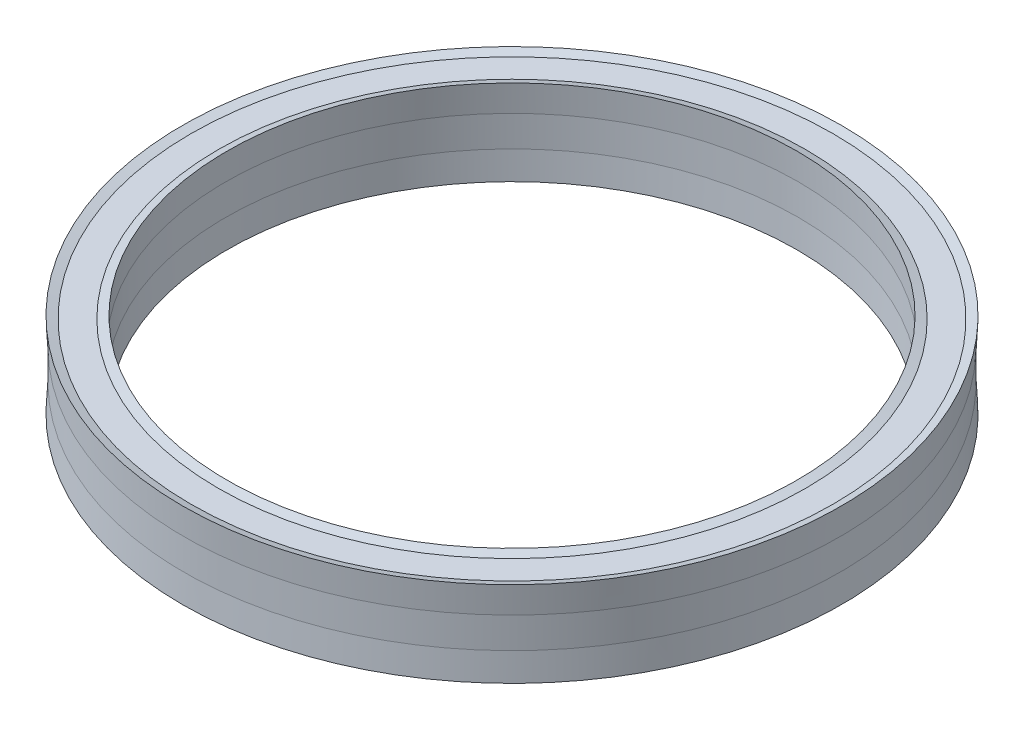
ISO-10303-21;
HEADER;
FILE_DESCRIPTION(('STEP AP214'),'2;1');
FILE_NAME('part.step','',(''),(''),'','','');
FILE_SCHEMA(('AUTOMOTIVE_DESIGN { 1 0 10303 214 1 1 1 1 }'));
ENDSEC;
DATA;
#1=APPLICATION_CONTEXT('core data for automotive mechanical design processes');
#2=APPLICATION_PROTOCOL_DEFINITION('international standard','automotive_design',2000,#1);
#3=PRODUCT_CONTEXT('',#1,'mechanical');
#4=PRODUCT('Part','Part','',(#3));
#5=PRODUCT_RELATED_PRODUCT_CATEGORY('part','',(#4));
#6=PRODUCT_DEFINITION_FORMATION('','',#4);
#7=PRODUCT_DEFINITION_CONTEXT('part definition',#1,'design');
#8=PRODUCT_DEFINITION('design','',#6,#7);
#9=PRODUCT_DEFINITION_SHAPE('','',#8);
#10=(LENGTH_UNIT() NAMED_UNIT(*) SI_UNIT(.MILLI.,.METRE.));
#11=(NAMED_UNIT(*) PLANE_ANGLE_UNIT() SI_UNIT($,.RADIAN.));
#12=(NAMED_UNIT(*) SI_UNIT($,.STERADIAN.) SOLID_ANGLE_UNIT());
#13=UNCERTAINTY_MEASURE_WITH_UNIT(LENGTH_MEASURE(1.E-05),#10,'distance_accuracy_value','');
#14=(GEOMETRIC_REPRESENTATION_CONTEXT(3) GLOBAL_UNCERTAINTY_ASSIGNED_CONTEXT((#13)) GLOBAL_UNIT_ASSIGNED_CONTEXT((#10,
#11,#12)) REPRESENTATION_CONTEXT('',''));
#15=CARTESIAN_POINT('',(0.,0.,0.));
#16=DIRECTION('',(0.,0.,1.));
#17=DIRECTION('',(1.,0.,0.));
#18=AXIS2_PLACEMENT_3D('',#15,#16,#17);
#19=CARTESIAN_POINT('',(0.,3.683,0.));
#20=DIRECTION('',(0.,-1.,0.));
#21=DIRECTION('',(0.,0.,-1.));
#22=AXIS2_PLACEMENT_3D('',#19,#20,#21);
#23=CONICAL_SURFACE('',#22,13.081,1.24904577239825);
#24=CARTESIAN_POINT('',(0.,3.81,0.));
#25=DIRECTION('',(0.,-1.,0.));
#26=DIRECTION('',(0.,0.,-1.));
#27=AXIS2_PLACEMENT_3D('',#24,#25,#26);
#28=CIRCLE('',#27,12.7);
#29=CARTESIAN_POINT('',(0.,3.81,-12.7));
#30=VERTEX_POINT('',#29);
#31=EDGE_CURVE('E68',#30,#30,#28,.T.);
#32=ORIENTED_EDGE('',*,*,#31,.T.);
#33=EDGE_LOOP('',(#32));
#34=FACE_BOUND('',#33,.T.);
#35=CARTESIAN_POINT('',(0.,3.683,0.));
#36=DIRECTION('',(0.,-1.,0.));
#37=DIRECTION('',(0.,0.,-1.));
#38=AXIS2_PLACEMENT_3D('',#35,#36,#37);
#39=CIRCLE('',#38,13.081);
#40=CARTESIAN_POINT('',(0.,3.683,-13.081));
#41=VERTEX_POINT('',#40);
#42=EDGE_CURVE('E10',#41,#41,#39,.T.);
#43=ORIENTED_EDGE('',*,*,#42,.F.);
#44=EDGE_LOOP('',(#43));
#45=FACE_BOUND('',#44,.T.);
#46=ADVANCED_FACE('F28',(#34,#45),#23,.T.);
#47=CARTESIAN_POINT('',(13.081,3.683,0.));
#48=DIRECTION('',(0.,1.,0.));
#49=DIRECTION('',(0.,0.,1.));
#50=AXIS2_PLACEMENT_3D('',#47,#48,#49);
#51=PLANE('',#50);
#52=ORIENTED_EDGE('',*,*,#42,.T.);
#53=EDGE_LOOP('',(#52));
#54=FACE_BOUND('',#53,.T.);
#55=CARTESIAN_POINT('',(0.,3.683,0.));
#56=DIRECTION('',(0.,-1.,0.));
#57=DIRECTION('',(0.,0.,-1.));
#58=AXIS2_PLACEMENT_3D('',#55,#56,#57);
#59=CIRCLE('',#58,14.303375);
#60=CARTESIAN_POINT('',(0.,3.683,-14.303375));
#61=VERTEX_POINT('',#60);
#62=EDGE_CURVE('E34',#61,#61,#59,.T.);
#63=ORIENTED_EDGE('',*,*,#62,.F.);
#64=EDGE_LOOP('',(#63));
#65=FACE_BOUND('',#64,.T.);
#66=ADVANCED_FACE('F86',(#54,#65),#51,.T.);
#67=CARTESIAN_POINT('',(0.,3.81,0.));
#68=DIRECTION('',(0.,1.,0.));
#69=DIRECTION('',(0.,0.,1.));
#70=AXIS2_PLACEMENT_3D('',#67,#68,#69);
#71=CONICAL_SURFACE('',#70,14.684375,1.24904577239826);
#72=ORIENTED_EDGE('',*,*,#62,.T.);
#73=EDGE_LOOP('',(#72));
#74=FACE_BOUND('',#73,.T.);
#75=CARTESIAN_POINT('',(0.,3.81,0.));
#76=DIRECTION('',(0.,-1.,0.));
#77=DIRECTION('',(0.,0.,-1.));
#78=AXIS2_PLACEMENT_3D('',#75,#76,#77);
#79=CIRCLE('',#78,14.684375);
#80=CARTESIAN_POINT('',(0.,3.81,-14.684375));
#81=VERTEX_POINT('',#80);
#82=EDGE_CURVE('E38',#81,#81,#79,.T.);
#83=ORIENTED_EDGE('',*,*,#82,.F.);
#84=EDGE_LOOP('',(#83));
#85=FACE_BOUND('',#84,.T.);
#86=ADVANCED_FACE('F90',(#74,#85),#71,.F.);
#87=CARTESIAN_POINT('',(0.,2.5908,0.));
#88=DIRECTION('',(0.,1.,0.));
#89=DIRECTION('',(0.,0.,1.));
#90=AXIS2_PLACEMENT_3D('',#87,#88,#89);
#91=CONICAL_SURFACE('',#90,14.620875,0.0520363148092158);
#92=ORIENTED_EDGE('',*,*,#82,.T.);
#93=EDGE_LOOP('',(#92));
#94=FACE_BOUND('',#93,.T.);
#95=CARTESIAN_POINT('',(0.,2.5908,0.));
#96=DIRECTION('',(0.,-1.,0.));
#97=DIRECTION('',(0.,0.,-1.));
#98=AXIS2_PLACEMENT_3D('',#95,#96,#97);
#99=CIRCLE('',#98,14.620875);
#100=CARTESIAN_POINT('',(0.,2.5908,-14.620875));
#101=VERTEX_POINT('',#100);
#102=EDGE_CURVE('E42',#101,#101,#99,.T.);
#103=ORIENTED_EDGE('',*,*,#102,.F.);
#104=EDGE_LOOP('',(#103));
#105=FACE_BOUND('',#104,.T.);
#106=ADVANCED_FACE('F94',(#94,#105),#91,.T.);
#107=CARTESIAN_POINT('',(0.,0.,0.));
#108=DIRECTION('',(0.,-1.,0.));
#109=DIRECTION('',(0.,0.,-1.));
#110=AXIS2_PLACEMENT_3D('',#107,#108,#109);
#111=CYLINDRICAL_SURFACE('',#110,14.620875);
#112=ORIENTED_EDGE('',*,*,#102,.T.);
#113=EDGE_LOOP('',(#112));
#114=FACE_BOUND('',#113,.T.);
#115=CARTESIAN_POINT('',(0.,1.2192,0.));
#116=DIRECTION('',(0.,-1.,0.));
#117=DIRECTION('',(0.,0.,-1.));
#118=AXIS2_PLACEMENT_3D('',#115,#116,#117);
#119=CIRCLE('',#118,14.620875);
#120=CARTESIAN_POINT('',(0.,1.2192,-14.620875));
#121=VERTEX_POINT('',#120);
#122=EDGE_CURVE('E47',#121,#121,#119,.T.);
#123=ORIENTED_EDGE('',*,*,#122,.F.);
#124=EDGE_LOOP('',(#123));
#125=FACE_BOUND('',#124,.T.);
#126=ADVANCED_FACE('F100',(#114,#125),#111,.T.);
#127=CARTESIAN_POINT('',(0.,0.,0.));
#128=DIRECTION('',(0.,-1.,0.));
#129=DIRECTION('',(0.,0.,-1.));
#130=AXIS2_PLACEMENT_3D('',#127,#128,#129);
#131=CONICAL_SURFACE('',#130,14.684375,0.0520363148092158);
#132=ORIENTED_EDGE('',*,*,#122,.T.);
#133=EDGE_LOOP('',(#132));
#134=FACE_BOUND('',#133,.T.);
#135=CARTESIAN_POINT('',(0.,0.,0.));
#136=DIRECTION('',(0.,-1.,0.));
#137=DIRECTION('',(0.,0.,-1.));
#138=AXIS2_PLACEMENT_3D('',#135,#136,#137);
#139=CIRCLE('',#138,14.684375);
#140=CARTESIAN_POINT('',(0.,0.,-14.684375));
#141=VERTEX_POINT('',#140);
#142=EDGE_CURVE('E50',#141,#141,#139,.T.);
#143=ORIENTED_EDGE('',*,*,#142,.F.);
#144=EDGE_LOOP('',(#143));
#145=FACE_BOUND('',#144,.T.);
#146=ADVANCED_FACE('F104',(#134,#145),#131,.T.);
#147=CARTESIAN_POINT('',(0.,0.127,0.));
#148=DIRECTION('',(0.,-1.,0.));
#149=DIRECTION('',(0.,0.,-1.));
#150=AXIS2_PLACEMENT_3D('',#147,#148,#149);
#151=CONICAL_SURFACE('',#150,14.303375,1.24904577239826);
#152=ORIENTED_EDGE('',*,*,#142,.T.);
#153=EDGE_LOOP('',(#152));
#154=FACE_BOUND('',#153,.T.);
#155=CARTESIAN_POINT('',(0.,0.127,0.));
#156=DIRECTION('',(0.,-1.,0.));
#157=DIRECTION('',(0.,0.,-1.));
#158=AXIS2_PLACEMENT_3D('',#155,#156,#157);
#159=CIRCLE('',#158,14.303375);
#160=CARTESIAN_POINT('',(0.,0.127,-14.303375));
#161=VERTEX_POINT('',#160);
#162=EDGE_CURVE('E53',#161,#161,#159,.T.);
#163=ORIENTED_EDGE('',*,*,#162,.F.);
#164=EDGE_LOOP('',(#163));
#165=FACE_BOUND('',#164,.T.);
#166=ADVANCED_FACE('F108',(#154,#165),#151,.F.);
#167=CARTESIAN_POINT('',(13.081,0.127,0.));
#168=DIRECTION('',(0.,-1.,0.));
#169=DIRECTION('',(0.,0.,-1.));
#170=AXIS2_PLACEMENT_3D('',#167,#168,#169);
#171=PLANE('',#170);
#172=ORIENTED_EDGE('',*,*,#162,.T.);
#173=EDGE_LOOP('',(#172));
#174=FACE_BOUND('',#173,.T.);
#175=CARTESIAN_POINT('',(0.,0.127,0.));
#176=DIRECTION('',(0.,-1.,0.));
#177=DIRECTION('',(0.,0.,-1.));
#178=AXIS2_PLACEMENT_3D('',#175,#176,#177);
#179=CIRCLE('',#178,13.081);
#180=CARTESIAN_POINT('',(0.,0.127,-13.081));
#181=VERTEX_POINT('',#180);
#182=EDGE_CURVE('E56',#181,#181,#179,.T.);
#183=ORIENTED_EDGE('',*,*,#182,.F.);
#184=EDGE_LOOP('',(#183));
#185=FACE_BOUND('',#184,.T.);
#186=ADVANCED_FACE('F112',(#174,#185),#171,.T.);
#187=CARTESIAN_POINT('',(0.,0.,0.));
#188=DIRECTION('',(0.,1.,0.));
#189=DIRECTION('',(0.,0.,1.));
#190=AXIS2_PLACEMENT_3D('',#187,#188,#189);
#191=CONICAL_SURFACE('',#190,12.7,1.24904577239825);
#192=ORIENTED_EDGE('',*,*,#182,.T.);
#193=EDGE_LOOP('',(#192));
#194=FACE_BOUND('',#193,.T.);
#195=CARTESIAN_POINT('',(0.,0.,0.));
#196=DIRECTION('',(0.,-1.,0.));
#197=DIRECTION('',(0.,0.,-1.));
#198=AXIS2_PLACEMENT_3D('',#195,#196,#197);
#199=CIRCLE('',#198,12.7);
#200=CARTESIAN_POINT('',(0.,0.,-12.7));
#201=VERTEX_POINT('',#200);
#202=EDGE_CURVE('E59',#201,#201,#199,.T.);
#203=ORIENTED_EDGE('',*,*,#202,.F.);
#204=EDGE_LOOP('',(#203));
#205=FACE_BOUND('',#204,.T.);
#206=ADVANCED_FACE('F116',(#194,#205),#191,.T.);
#207=CARTESIAN_POINT('',(0.,1.2192,0.));
#208=DIRECTION('',(0.,1.,0.));
#209=DIRECTION('',(0.,0.,1.));
#210=AXIS2_PLACEMENT_3D('',#207,#208,#209);
#211=CONICAL_SURFACE('',#210,12.7635,0.0520363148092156);
#212=ORIENTED_EDGE('',*,*,#202,.T.);
#213=EDGE_LOOP('',(#212));
#214=FACE_BOUND('',#213,.T.);
#215=CARTESIAN_POINT('',(0.,1.2192,0.));
#216=DIRECTION('',(0.,-1.,0.));
#217=DIRECTION('',(0.,0.,-1.));
#218=AXIS2_PLACEMENT_3D('',#215,#216,#217);
#219=CIRCLE('',#218,12.7635);
#220=CARTESIAN_POINT('',(0.,1.2192,-12.7635));
#221=VERTEX_POINT('',#220);
#222=EDGE_CURVE('E62',#221,#221,#219,.T.);
#223=ORIENTED_EDGE('',*,*,#222,.F.);
#224=EDGE_LOOP('',(#223));
#225=FACE_BOUND('',#224,.T.);
#226=ADVANCED_FACE('F82',(#214,#225),#211,.F.);
#227=CARTESIAN_POINT('',(0.,0.,0.));
#228=DIRECTION('',(0.,-1.,0.));
#229=DIRECTION('',(0.,0.,-1.));
#230=AXIS2_PLACEMENT_3D('',#227,#228,#229);
#231=CYLINDRICAL_SURFACE('',#230,12.7635);
#232=ORIENTED_EDGE('',*,*,#222,.T.);
#233=EDGE_LOOP('',(#232));
#234=FACE_BOUND('',#233,.T.);
#235=CARTESIAN_POINT('',(0.,2.5908,0.));
#236=DIRECTION('',(0.,-1.,0.));
#237=DIRECTION('',(0.,0.,-1.));
#238=AXIS2_PLACEMENT_3D('',#235,#236,#237);
#239=CIRCLE('',#238,12.7635);
#240=CARTESIAN_POINT('',(0.,2.5908,-12.7635));
#241=VERTEX_POINT('',#240);
#242=EDGE_CURVE('E65',#241,#241,#239,.T.);
#243=ORIENTED_EDGE('',*,*,#242,.F.);
#244=EDGE_LOOP('',(#243));
#245=FACE_BOUND('',#244,.T.);
#246=ADVANCED_FACE('F76',(#234,#245),#231,.F.);
#247=CARTESIAN_POINT('',(0.,3.81,0.));
#248=DIRECTION('',(0.,-1.,0.));
#249=DIRECTION('',(0.,0.,-1.));
#250=AXIS2_PLACEMENT_3D('',#247,#248,#249);
#251=CONICAL_SURFACE('',#250,12.7,0.0520363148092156);
#252=ORIENTED_EDGE('',*,*,#242,.T.);
#253=EDGE_LOOP('',(#252));
#254=FACE_BOUND('',#253,.T.);
#255=ORIENTED_EDGE('',*,*,#31,.F.);
#256=EDGE_LOOP('',(#255));
#257=FACE_BOUND('',#256,.T.);
#258=ADVANCED_FACE('F74',(#254,#257),#251,.F.);
#259=CLOSED_SHELL('',(#46,#66,#86,#106,#126,#146,#166,#186,#206,#226,#246,#258));
#260=MANIFOLD_SOLID_BREP('B2',#259);
#261=ADVANCED_BREP_SHAPE_REPRESENTATION('',(#18,#260),#14);
#262=SHAPE_DEFINITION_REPRESENTATION(#9,#261);
ENDSEC;
END-ISO-10303-21;
